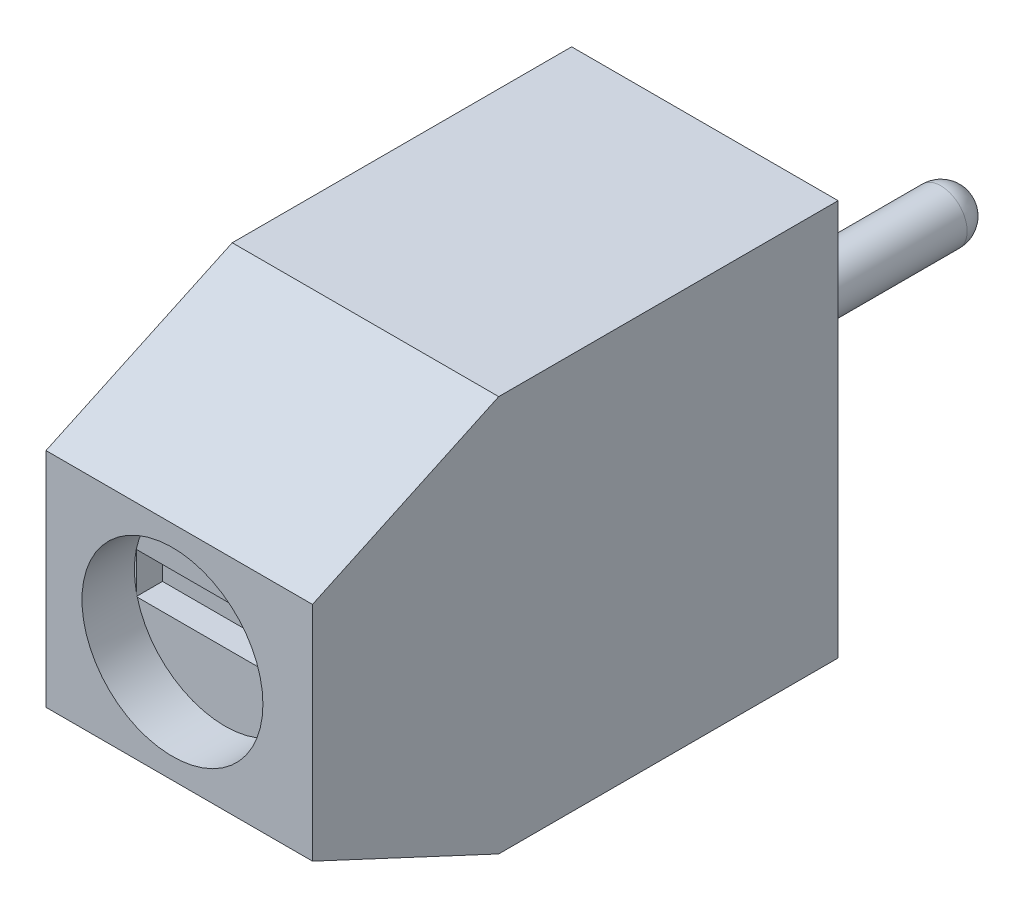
from build123d import *
from OCP.BRepFilletAPI import BRepFilletAPI_MakeChamfer

# Parameters (mm, degrees)
ESQUISSE1_W             = 10.16
ESQUISSE1_H             = 7.55
EXTRUSION1_DEPTH        = 10.02
CHANFREIN1_SIZE         = 3.55
CHANFREIN1_SIZE2        = 1.655392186
ESQUISSE2_R             = 1.725
ENL_V_MAT_EXTRU_1_DEPTH = 1
ESQUISSE3_W             = 4
ESQUISSE3_H             = 5
ENL_V_MAT_EXTRU_2_DEPTH = 1.6
ESQUISSE4_R             = 1.675
ENL_V_MAT_EXTRU_3_DEPTH = 1.6
ESQUISSE5_R             = 0.5
EXTRUSION2_DEPTH        = 5
CONG_1_R                = 0.5
ESQUISSE7_W             = 3.359641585
ESQUISSE7_H             = 0.780050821
ESQUISSE7_W_2           = 3.169641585
ESQUISSE7_H_2           = 1.23511091
ENL_V_MAT_EXTRU_4_DEPTH = 0.5
ESQUISSE8_W             = 3.1960084
ESQUISSE8_H             = 1.003036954
ESQUISSE8_W_2           = 3.1010084
ESQUISSE8_H_2           = 1.248310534
ENL_V_MAT_EXTRU_5_DEPTH = 0.5
ESQUISSE9_W             = 5.973351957
ESQUISSE9_H             = 10.380656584
ENL_V_MAT_EXTRU_6_DEPTH = 20.642517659


with BuildPart() as part:
    # Esquisse1 → Extrusion1 (new body)
    with BuildSketch(Plane.XY):
        with Locations((5.08, 3.775)):
            Rectangle(ESQUISSE1_W, ESQUISSE1_H)
    extrude(amount=EXTRUSION1_DEPTH)

    # Chanfrein1: one chamfer whose edges measure the first distance from different faces: ONE call of the kernel's chamfer builder (chamfer() names one face for all edges)
    chanfrein1_edges_1 = [part.edges().sort_by_distance(p)[0] for p in [
        (5.08, 7.55, 10.02),
    ]]
    chanfrein1_side_1 = [part.faces().sort_by_distance(p)[0] for p in [
        (5.08, 7.55, 5.01),
    ]]
    chanfrein1_edges_2 = [part.edges().sort_by_distance(p)[0] for p in [
        (5.08, 0, 10.02),
    ]]
    chanfrein1_side_2 = [part.faces().sort_by_distance(p)[0] for p in [
        (5.08, 0, 5.01),
    ]]
    chanfrein1 = BRepFilletAPI_MakeChamfer(part.part.solid().wrapped)
    for e in chanfrein1_edges_1:
        chanfrein1.Add(CHANFREIN1_SIZE, CHANFREIN1_SIZE2, e.wrapped, chanfrein1_side_1[0].wrapped)  # the first distance lies on this face
    for e in chanfrein1_edges_2:
        chanfrein1.Add(CHANFREIN1_SIZE, CHANFREIN1_SIZE2, e.wrapped, chanfrein1_side_2[0].wrapped)  # the first distance lies on this face
    add(Compound.cast(chanfrein1.Shape()), mode=Mode.REPLACE)

    # Esquisse2 → Enl_v. mat.-Extru.1 (cut)
    with BuildSketch(Plane.XY.offset(10.02)):
        with Locations((2.410120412, 3.775)):
            Circle(ESQUISSE2_R)
        with Locations((7.749879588, 3.775)):
            Circle(ESQUISSE2_R)
    extrude(amount=-ENL_V_MAT_EXTRU_1_DEPTH, mode=Mode.SUBTRACT)

    # Esquisse3 → Enl_v. mat.-Extru.2 (cut)
    with BuildSketch(Plane.XZ):
        with Locations((7.53, 3.3)):
            Rectangle(ESQUISSE3_W, ESQUISSE3_H)
        with Locations((2.63, 3.3)):
            Rectangle(ESQUISSE3_W, ESQUISSE3_H)
    extrude(amount=-ENL_V_MAT_EXTRU_2_DEPTH, mode=Mode.SUBTRACT)

    # Esquisse4 → Enl_v. mat.-Extru.3 (cut)
    with BuildSketch(Plane.XZ.offset(-1.6)):
        with Locations(Location((7.53, 3.235, 0), (0, 0, 270))):
            Circle(ESQUISSE4_R)
        with Locations(Location((2.535, 3.235, 0), (0, 0, 270))):
            Circle(ESQUISSE4_R)
    extrude(amount=-ENL_V_MAT_EXTRU_3_DEPTH, mode=Mode.SUBTRACT)

    # Esquisse5 → Extrusion2 (add)
    with BuildSketch(Plane(origin=(0, 0, 0), x_dir=(-1, 0, 0), z_dir=(0, 0, -1))):
        with Locations((-7.62, 3.775)):
            Circle(ESQUISSE5_R)
        with Locations((-2.54, 3.775)):
            Circle(ESQUISSE5_R)
    extrude(amount=EXTRUSION2_DEPTH)

    # Cong_1
    cong_1_edges = [part.edges().sort_by_distance(p)[0] for p in [
        (8.12, 3.775, -5),
        (3.04, 3.775, -5),
    ]]
    fillet(cong_1_edges, radius=CONG_1_R)

    # Esquisse7 → Enl_v. mat.-Extru.4 (cut)
    with BuildSketch(Plane.XY.offset(9.02)):
        with Locations((2.40077537, 3.734751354)):
            Rectangle(ESQUISSE7_W, ESQUISSE7_H)
        with Locations((7.645534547, 3.507221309)):
            Rectangle(ESQUISSE7_W_2, ESQUISSE7_H_2)
    extrude(amount=-ENL_V_MAT_EXTRU_4_DEPTH, mode=Mode.SUBTRACT)

    # Esquisse8 → Enl_v. mat.-Extru.5 (cut)
    with BuildSketch(Plane.XZ.offset(-3.2)):
        with Locations((2.54160667, 3.256051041)):
            Rectangle(ESQUISSE8_W, ESQUISSE8_H)
        with Locations((7.48910667, 3.133414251)):
            Rectangle(ESQUISSE8_W_2, ESQUISSE8_H_2)
    extrude(amount=-ENL_V_MAT_EXTRU_5_DEPTH, mode=Mode.SUBTRACT)

    # Esquisse9 → Enl_v. mat.-Extru.6 (cut, through all)
    with BuildSketch(Plane.XY.offset(10.02)):
        with Locations((8.066675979, 3.96516289)):
            Rectangle(ESQUISSE9_W, ESQUISSE9_H)
    extrude(amount=-ENL_V_MAT_EXTRU_6_DEPTH, mode=Mode.SUBTRACT)


solid = part.part
